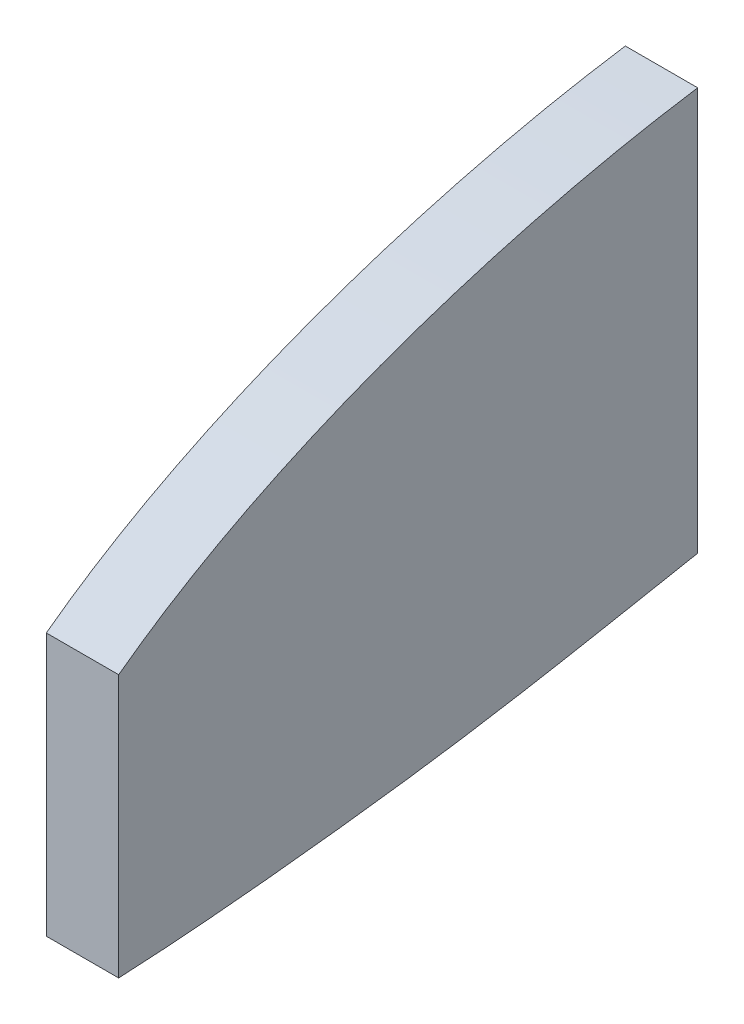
ISO-10303-21;
HEADER;
FILE_DESCRIPTION(('STEP AP214'),'2;1');
FILE_NAME('part.step','',(''),(''),'','','');
FILE_SCHEMA(('AUTOMOTIVE_DESIGN { 1 0 10303 214 1 1 1 1 }'));
ENDSEC;
DATA;
#1=APPLICATION_CONTEXT('core data for automotive mechanical design processes');
#2=APPLICATION_PROTOCOL_DEFINITION('international standard','automotive_design',2000,#1);
#3=PRODUCT_CONTEXT('',#1,'mechanical');
#4=PRODUCT('Part','Part','',(#3));
#5=PRODUCT_RELATED_PRODUCT_CATEGORY('part','',(#4));
#6=PRODUCT_DEFINITION_FORMATION('','',#4);
#7=PRODUCT_DEFINITION_CONTEXT('part definition',#1,'design');
#8=PRODUCT_DEFINITION('design','',#6,#7);
#9=PRODUCT_DEFINITION_SHAPE('','',#8);
#10=(LENGTH_UNIT() NAMED_UNIT(*) SI_UNIT(.MILLI.,.METRE.));
#11=(NAMED_UNIT(*) PLANE_ANGLE_UNIT() SI_UNIT($,.RADIAN.));
#12=(NAMED_UNIT(*) SI_UNIT($,.STERADIAN.) SOLID_ANGLE_UNIT());
#13=UNCERTAINTY_MEASURE_WITH_UNIT(LENGTH_MEASURE(1.E-05),#10,'distance_accuracy_value','');
#14=(GEOMETRIC_REPRESENTATION_CONTEXT(3) GLOBAL_UNCERTAINTY_ASSIGNED_CONTEXT((#13)) GLOBAL_UNIT_ASSIGNED_CONTEXT((#10,
#11,#12)) REPRESENTATION_CONTEXT('',''));
#15=CARTESIAN_POINT('',(0.,0.,0.));
#16=DIRECTION('',(0.,0.,1.));
#17=DIRECTION('',(1.,0.,0.));
#18=AXIS2_PLACEMENT_3D('',#15,#16,#17);
#19=CARTESIAN_POINT('',(3.175,18.9086575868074,-31.75));
#20=CARTESIAN_POINT('',(3.175,18.7680576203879,-30.8282390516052));
#21=CARTESIAN_POINT('',(3.175,18.3939895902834,-28.6506280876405));
#22=CARTESIAN_POINT('',(3.175,17.6485448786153,-25.2979659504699));
#23=CARTESIAN_POINT('',(3.175,16.6729418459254,-21.7621593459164));
#24=CARTESIAN_POINT('',(3.175,15.5707536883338,-18.4462085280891));
#25=CARTESIAN_POINT('',(3.175,14.3677769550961,-15.36422319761));
#26=CARTESIAN_POINT('',(3.175,13.0704558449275,-12.5353548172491));
#27=CARTESIAN_POINT('',(3.175,11.7051463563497,-9.96868307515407));
#28=CARTESIAN_POINT('',(3.175,10.4452751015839,-7.93326586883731));
#29=CARTESIAN_POINT('',(3.175,9.62436987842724,-6.77084144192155));
#30=CARTESIAN_POINT('',(3.175,9.31142365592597,-6.35));
#31=B_SPLINE_CURVE_WITH_KNOTS('',3,(#19,#20,#21,#22,#23,#24,#25,#26,#27,#28,#29,#30),
.UNSPECIFIED.,.F.,.F.,(4,1,1,1,1,1,1,1,1,4),(1.38351151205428,1.39265296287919,1.4051703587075,
1.41717191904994,1.42860351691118,1.43941895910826,1.44959658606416,1.45910207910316,
1.46790787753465,1.47304908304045),.UNSPECIFIED.);
#32=DIRECTION('',(-1.,0.,0.));
#33=VECTOR('',#32,1.);
#34=SURFACE_OF_LINEAR_EXTRUSION('',#31,#33);
#35=CARTESIAN_POINT('',(0.,18.9086575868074,-31.75));
#36=CARTESIAN_POINT('',(0.,18.7680576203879,-30.8282390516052));
#37=CARTESIAN_POINT('',(0.,18.3939895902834,-28.6506280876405));
#38=CARTESIAN_POINT('',(0.,17.6485448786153,-25.2979659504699));
#39=CARTESIAN_POINT('',(0.,16.6729418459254,-21.7621593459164));
#40=CARTESIAN_POINT('',(0.,15.5707536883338,-18.4462085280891));
#41=CARTESIAN_POINT('',(0.,14.3677769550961,-15.36422319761));
#42=CARTESIAN_POINT('',(0.,13.0704558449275,-12.5353548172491));
#43=CARTESIAN_POINT('',(0.,11.7051463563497,-9.96868307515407));
#44=CARTESIAN_POINT('',(0.,10.4452751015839,-7.93326586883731));
#45=CARTESIAN_POINT('',(0.,9.62436987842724,-6.77084144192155));
#46=CARTESIAN_POINT('',(0.,9.31142365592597,-6.35));
#47=B_SPLINE_CURVE_WITH_KNOTS('',3,(#35,#36,#37,#38,#39,#40,#41,#42,#43,#44,#45,#46),
.UNSPECIFIED.,.F.,.F.,(4,1,1,1,1,1,1,1,1,4),(1.38351151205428,1.39265296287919,1.4051703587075,
1.41717191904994,1.42860351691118,1.43941895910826,1.44959658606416,1.45910207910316,
1.46790787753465,1.47304908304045),.UNSPECIFIED.);
#48=CARTESIAN_POINT('',(0.,18.9086575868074,-31.75));
#49=VERTEX_POINT('',#48);
#50=CARTESIAN_POINT('',(0.,9.31142365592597,-6.35));
#51=VERTEX_POINT('',#50);
#52=EDGE_CURVE('E116',#49,#51,#47,.T.);
#53=ORIENTED_EDGE('',*,*,#52,.T.);
#54=DIRECTION('',(-1.,0.,0.));
#55=VECTOR('',#54,1.);
#56=CARTESIAN_POINT('',(3.175,9.31142365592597,-6.35));
#57=LINE('',#56,#55);
#58=CARTESIAN_POINT('',(3.175,9.31142365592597,-6.35));
#59=VERTEX_POINT('',#58);
#60=EDGE_CURVE('E11',#59,#51,#57,.T.);
#61=ORIENTED_EDGE('',*,*,#60,.F.);
#62=CARTESIAN_POINT('',(3.175,18.9086575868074,-31.75));
#63=VERTEX_POINT('',#62);
#64=EDGE_CURVE('E85',#63,#59,#31,.T.);
#65=ORIENTED_EDGE('',*,*,#64,.F.);
#66=DIRECTION('',(-1.,0.,0.));
#67=VECTOR('',#66,1.);
#68=CARTESIAN_POINT('',(3.175,18.9086575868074,-31.75));
#69=LINE('',#68,#67);
#70=EDGE_CURVE('E93',#63,#49,#69,.T.);
#71=ORIENTED_EDGE('',*,*,#70,.T.);
#72=EDGE_LOOP('',(#53,#61,#65,#71));
#73=FACE_BOUND('',#72,.T.);
#74=ADVANCED_FACE('F33',(#73),#34,.F.);
#75=CARTESIAN_POINT('',(3.175,9.31142365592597,-6.35));
#76=DIRECTION('',(0.,0.,-1.));
#77=DIRECTION('',(0.,1.,0.));
#78=AXIS2_PLACEMENT_3D('',#75,#76,#77);
#79=PLANE('',#78);
#80=DIRECTION('',(0.,-1.,0.));
#81=VECTOR('',#80,1.);
#82=CARTESIAN_POINT('',(0.,9.31142365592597,-6.35));
#83=LINE('',#82,#81);
#84=CARTESIAN_POINT('',(0.,-2.21046306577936,-6.34999999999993));
#85=VERTEX_POINT('',#84);
#86=EDGE_CURVE('E89',#51,#85,#83,.T.);
#87=ORIENTED_EDGE('',*,*,#86,.T.);
#88=DIRECTION('',(-1.,0.,0.));
#89=VECTOR('',#88,1.);
#90=CARTESIAN_POINT('',(3.175,-2.21046306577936,-6.34999999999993));
#91=LINE('',#90,#89);
#92=CARTESIAN_POINT('',(3.175,-2.21046306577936,-6.34999999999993));
#93=VERTEX_POINT('',#92);
#94=EDGE_CURVE('E42',#93,#85,#91,.T.);
#95=ORIENTED_EDGE('',*,*,#94,.F.);
#96=DIRECTION('',(0.,-1.,0.));
#97=VECTOR('',#96,1.);
#98=CARTESIAN_POINT('',(3.175,9.31142365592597,-6.35));
#99=LINE('',#98,#97);
#100=EDGE_CURVE('E80',#59,#93,#99,.T.);
#101=ORIENTED_EDGE('',*,*,#100,.F.);
#102=ORIENTED_EDGE('',*,*,#60,.T.);
#103=EDGE_LOOP('',(#87,#95,#101,#102));
#104=FACE_BOUND('',#103,.T.);
#105=ADVANCED_FACE('F88',(#104),#79,.F.);
#106=CARTESIAN_POINT('',(3.175,-2.21046306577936,-6.35));
#107=CARTESIAN_POINT('',(3.175,-2.20381132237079,-6.4865666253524));
#108=CARTESIAN_POINT('',(3.175,-2.14820496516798,-7.56554839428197));
#109=CARTESIAN_POINT('',(3.175,-2.00528239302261,-9.72937621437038));
#110=CARTESIAN_POINT('',(3.175,-1.70699153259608,-12.9698175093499));
#111=CARTESIAN_POINT('',(3.175,-1.3031322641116,-16.6022606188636));
#112=CARTESIAN_POINT('',(3.175,-0.785005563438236,-20.6089964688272));
#113=CARTESIAN_POINT('',(3.175,-0.0604260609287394,-24.9880988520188));
#114=CARTESIAN_POINT('',(3.175,0.653519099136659,-28.7373127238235));
#115=CARTESIAN_POINT('',(3.175,1.09214790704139,-31.0394912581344));
#116=CARTESIAN_POINT('',(3.175,1.2273317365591,-31.75));
#117=B_SPLINE_CURVE_WITH_KNOTS('',3,(#106,#107,#108,#109,#110,#111,#112,#113,#114,#115,#116),
.UNSPECIFIED.,.F.,.F.,(4,1,1,1,1,1,1,1,4),(0.536375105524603,0.537715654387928,
0.546967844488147,0.557637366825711,0.569620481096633,0.582804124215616,0.597246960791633,
0.613135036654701,0.620226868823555),.UNSPECIFIED.);
#118=DIRECTION('',(-1.,0.,0.));
#119=VECTOR('',#118,1.);
#120=SURFACE_OF_LINEAR_EXTRUSION('',#117,#119);
#121=CARTESIAN_POINT('',(0.,-2.21046306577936,-6.35));
#122=CARTESIAN_POINT('',(0.,-2.20381132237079,-6.4865666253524));
#123=CARTESIAN_POINT('',(0.,-2.14820496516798,-7.56554839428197));
#124=CARTESIAN_POINT('',(0.,-2.00528239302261,-9.72937621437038));
#125=CARTESIAN_POINT('',(0.,-1.70699153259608,-12.9698175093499));
#126=CARTESIAN_POINT('',(0.,-1.3031322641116,-16.6022606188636));
#127=CARTESIAN_POINT('',(0.,-0.785005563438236,-20.6089964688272));
#128=CARTESIAN_POINT('',(0.,-0.0604260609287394,-24.9880988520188));
#129=CARTESIAN_POINT('',(0.,0.653519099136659,-28.7373127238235));
#130=CARTESIAN_POINT('',(0.,1.09214790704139,-31.0394912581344));
#131=CARTESIAN_POINT('',(0.,1.2273317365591,-31.75));
#132=B_SPLINE_CURVE_WITH_KNOTS('',3,(#121,#122,#123,#124,#125,#126,#127,#128,#129,#130,#131),
.UNSPECIFIED.,.F.,.F.,(4,1,1,1,1,1,1,1,4),(0.536375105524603,0.537715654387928,
0.546967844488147,0.557637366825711,0.569620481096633,0.582804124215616,0.597246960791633,
0.613135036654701,0.620226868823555),.UNSPECIFIED.);
#133=CARTESIAN_POINT('',(0.,1.2273317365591,-31.75));
#134=VERTEX_POINT('',#133);
#135=EDGE_CURVE('E67',#85,#134,#132,.T.);
#136=ORIENTED_EDGE('',*,*,#135,.T.);
#137=DIRECTION('',(-1.,0.,0.));
#138=VECTOR('',#137,1.);
#139=CARTESIAN_POINT('',(3.175,1.2273317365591,-31.75));
#140=LINE('',#139,#138);
#141=CARTESIAN_POINT('',(3.175,1.2273317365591,-31.75));
#142=VERTEX_POINT('',#141);
#143=EDGE_CURVE('E90',#142,#134,#140,.T.);
#144=ORIENTED_EDGE('',*,*,#143,.F.);
#145=EDGE_CURVE('E83',#93,#142,#117,.T.);
#146=ORIENTED_EDGE('',*,*,#145,.F.);
#147=ORIENTED_EDGE('',*,*,#94,.T.);
#148=EDGE_LOOP('',(#136,#144,#146,#147));
#149=FACE_BOUND('',#148,.T.);
#150=ADVANCED_FACE('F91',(#149),#120,.F.);
#151=CARTESIAN_POINT('',(3.175,18.9086575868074,-31.75));
#152=DIRECTION('',(0.,0.,1.));
#153=DIRECTION('',(0.,-1.,0.));
#154=AXIS2_PLACEMENT_3D('',#151,#152,#153);
#155=PLANE('',#154);
#156=DIRECTION('',(0.,1.,0.));
#157=VECTOR('',#156,1.);
#158=CARTESIAN_POINT('',(0.,18.9086575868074,-31.75));
#159=LINE('',#158,#157);
#160=EDGE_CURVE('E73',#134,#49,#159,.T.);
#161=ORIENTED_EDGE('',*,*,#160,.T.);
#162=ORIENTED_EDGE('',*,*,#70,.F.);
#163=DIRECTION('',(0.,1.,0.));
#164=VECTOR('',#163,1.);
#165=CARTESIAN_POINT('',(3.175,18.9086575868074,-31.75));
#166=LINE('',#165,#164);
#167=EDGE_CURVE('E50',#142,#63,#166,.T.);
#168=ORIENTED_EDGE('',*,*,#167,.F.);
#169=ORIENTED_EDGE('',*,*,#143,.T.);
#170=EDGE_LOOP('',(#161,#162,#168,#169));
#171=FACE_BOUND('',#170,.T.);
#172=ADVANCED_FACE('F105',(#171),#155,.F.);
#173=CARTESIAN_POINT('',(3.175,15.5556187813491,-18.4899715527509));
#174=DIRECTION('',(-1.,0.,0.));
#175=DIRECTION('',(0.,0.,1.));
#176=AXIS2_PLACEMENT_3D('',#173,#174,#175);
#177=PLANE('',#176);
#178=ORIENTED_EDGE('',*,*,#64,.T.);
#179=ORIENTED_EDGE('',*,*,#100,.T.);
#180=ORIENTED_EDGE('',*,*,#145,.T.);
#181=ORIENTED_EDGE('',*,*,#167,.T.);
#182=EDGE_LOOP('',(#178,#179,#180,#181));
#183=FACE_BOUND('',#182,.T.);
#184=ADVANCED_FACE('F81',(#183),#177,.F.);
#185=CARTESIAN_POINT('',(0.,15.5556187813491,-18.4899715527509));
#186=DIRECTION('',(-1.,0.,0.));
#187=DIRECTION('',(0.,0.,1.));
#188=AXIS2_PLACEMENT_3D('',#185,#186,#187);
#189=PLANE('',#188);
#190=ORIENTED_EDGE('',*,*,#52,.F.);
#191=ORIENTED_EDGE('',*,*,#160,.F.);
#192=ORIENTED_EDGE('',*,*,#135,.F.);
#193=ORIENTED_EDGE('',*,*,#86,.F.);
#194=EDGE_LOOP('',(#190,#191,#192,#193));
#195=FACE_BOUND('',#194,.T.);
#196=ADVANCED_FACE('F133',(#195),#189,.T.);
#197=CLOSED_SHELL('',(#74,#105,#150,#172,#184,#196));
#198=MANIFOLD_SOLID_BREP('B2',#197);
#199=ADVANCED_BREP_SHAPE_REPRESENTATION('',(#18,#198),#14);
#200=SHAPE_DEFINITION_REPRESENTATION(#9,#199);
ENDSEC;
END-ISO-10303-21;
